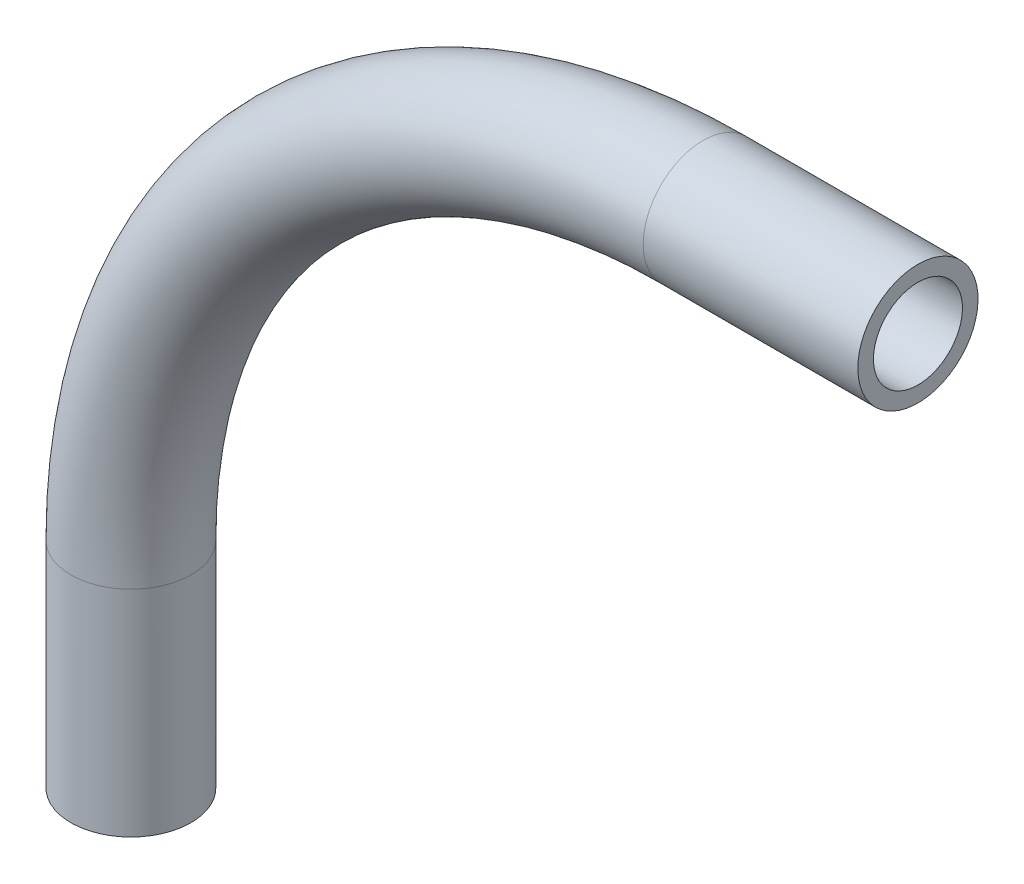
from build123d import *

# Parameters (mm, degrees)
ROUTE_R                       = 10.668
ELBOWSHELL_T                  = -2.7686
SKETCH2_R                     = 10.668
SKETCH2_R_2                   = 7.8994
ELBOWEXTENSION_EXTRUDE1_DEPTH = 38.1
SKETCH3_R                     = 10.668
SKETCH3_R_2                   = 7.8994
ELBOWEXTENSION_EXTRUDE2_DEPTH = 38.1


with BuildPart() as part:
    # Elbow: sweep along a path in ElbowArc
    with BuildLine(Plane.XY) as elbow_path:
        ThreePointArc((-101.6, 0), (-71.842048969, 71.842048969), (0, 101.6))
    # Route → Elbow (sweep)
    with BuildSketch(Plane(origin=(0, 0, 0), x_dir=(1, 0, 0), z_dir=(0, 1, 0))):
        with Locations((-101.6, 0)):
            Circle(ROUTE_R)
    sweep(path=elbow_path.line)

    # ElbowShell
    elbowshell_openings = [part.faces().sort_by_distance(p)[0] for p in [
        (0, 101.6, 0),
        (-101.6, 0, 0),
    ]]
    offset(amount=ELBOWSHELL_T, openings=elbowshell_openings, kind=Kind.INTERSECTION)

    # Sketch2 → ElbowExtension-Extrude1 (add)
    with BuildSketch(Plane(origin=(0, 0, 0), x_dir=(0, 0, -1), z_dir=(1, 0, 0))):
        with Locations(Location((0, 101.6, 0), (0, 0, 90))):
            Circle(SKETCH2_R)
        with Locations(Location((0, 101.6, 0), (0, 0, 90))):
            Circle(SKETCH2_R_2, mode=Mode.SUBTRACT)
    extrude(amount=ELBOWEXTENSION_EXTRUDE1_DEPTH)

    # Sketch3 → ElbowExtension-Extrude2 (add)
    with BuildSketch(Plane.XZ):
        with Locations(Location((-101.6, 0, 0), (0, 0, 180))):
            Circle(SKETCH3_R)
        with Locations(Location((-101.6, 0, 0), (0, 0, 180))):
            Circle(SKETCH3_R_2, mode=Mode.SUBTRACT)
    extrude(amount=ELBOWEXTENSION_EXTRUDE2_DEPTH)


solid = part.part
